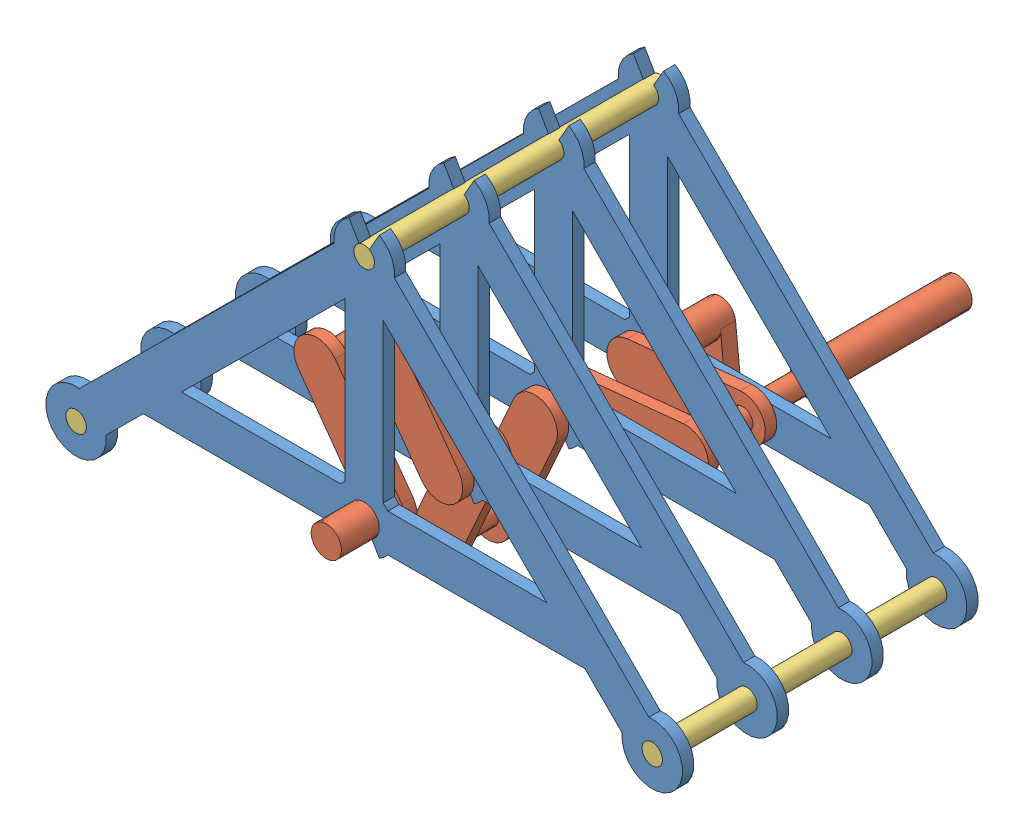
SolidWorks assembly 驱动结构.SLDASM, configuration 默认 (file format 15000). Lengths in mm.
Overall size (84 50.43 82).
8 component instances, 3 part files, 19 mates.
Components (placement in the parent):
- 两侧三角支架-1: 两侧三角支架.SLDPRT [默认] at (0.7562 -6.4117 -2.8963) size (84 45.26 1.5)
- 中心摇杆-2: 中心摇杆.SLDPRT [默认] at (0.7562 -6.4117 -2.8963) x (0.100452 -0.994942 0) z (0 0 1) size (31.98 28.5 82)
- 两侧三角支架-2: 两侧三角支架.SLDPRT [默认] at (0.7562 -6.4117 9.6037) size (84 45.26 1.5)
- 两侧三角支架-4: 两侧三角支架.SLDPRT [默认] at (0.7562 -6.4117 22.1037) size (84 45.26 1.5)
- 两侧三角支架-5: 两侧三角支架.SLDPRT [默认] at (0.7562 -6.4117 34.6037) size (84 45.26 1.5)
- 圆柱-1: 圆柱.SLDPRT [默认] at (0.7562 23.5883 -2.8963) size (2.7 2.7 39)
- 圆柱-2: 圆柱.SLDPRT [默认] at (38.7562 -14.2117 -2.8963) size (2.7 2.7 39)
- 圆柱-3: 圆柱.SLDPRT [默认] at (-37.2438 -14.2117 -2.8963) size (2.7 2.7 39)
Mates (geometry in assembly coordinates):
- 同心1: concentric aligned: cylinder of 两侧三角支架-1 through (0.7562 -6.4117 -1.3963) axis (0 0 -1) radius 1.35; cylinder of 中心摇杆-2 through (0.7562 -6.4117 -0.3963) axis (0 0 -1) radius 1.35
- 重合1: coincident anti-aligned: plane of 两侧三角支架-1 through (0.7562 -6.4117 -1.3963) normal (0 0 1); plane of 中心摇杆-2 through (0.7562 -6.4117 -1.3963) normal (0 0 -1)
- 同心2: concentric aligned: line of 中心摇杆-2 through (0.7562 -6.4117 11.1037) axis (0 0 -1); cylinder of 两侧三角支架-2 through (0.7562 -6.4117 11.1037) axis (0 0 -1) radius 1.35
- 重合2: coincident anti-aligned: plane of 中心摇杆-2 through (0.7562 -6.4117 9.6037) normal (0 0 1); plane of 两侧三角支架-2 through (0.7562 -6.4117 9.6037) normal (0 0 -1)
- 平行1: parallel aligned: line of 两侧三角支架-1 through (38.3056 -10.2372 -2.8963) axis (-0.70897 0.705239 0); line of 两侧三角支架-2 through (38.3056 -10.2372 9.6037) axis (-0.70897 0.705239 0)
- 同心3: concentric aligned: line of 中心摇杆-2 through (0.7562 -6.4117 23.6037) axis (0 0 -1); cylinder of 两侧三角支架-4 through (0.7562 -6.4117 23.6037) axis (0 0 -1) radius 1.35
- 同心4: concentric aligned: cylinder of 中心摇杆-2 through (0.7562 -6.4117 24.6037) axis (0 0 -1) radius 1.35; cylinder of 两侧三角支架-4 through (0.7562 -6.4117 23.6037) axis (0 0 -1) radius 1.35
- 重合4: coincident anti-aligned: plane of 中心摇杆-2 through (0.7562 -6.4117 22.1037) normal (0 0 1); plane of 两侧三角支架-4 through (0.7562 -6.4117 22.1037) normal (0 0 -1)
- 平行2: parallel aligned: line of 两侧三角支架-2 through (38.3056 -10.2372 9.6037) axis (-0.70897 0.705239 0); line of 两侧三角支架-4 through (38.3056 -10.2372 22.1037) axis (-0.70897 0.705239 0)
- 同心5: concentric aligned: cylinder of 中心摇杆-2 through (0.7562 -6.4117 36.1037) axis (0 0 -1) radius 1.35; cylinder of 两侧三角支架-5 through (0.7562 -6.4117 36.1037) axis (0 0 -1) radius 1.35
- 重合6: coincident anti-aligned: plane of 中心摇杆-2 through (0.7562 -6.4117 34.6037) normal (0 0 1); plane of 两侧三角支架-5 through (0.7562 -6.4117 34.6037) normal (0 0 -1)
- 同心6: concentric aligned: cylinder of 两侧三角支架-1 through (0.7562 23.5883 -1.3963) axis (0 0 -1) radius 1.35; cylinder of 圆柱-1 through (0.7562 23.5883 36.1037) axis (0 0 -1) radius 1.35
- 重合7: coincident aligned: plane of 两侧三角支架-1 through (0.7562 -6.4117 -2.8963) normal (0 0 -1); plane of 圆柱-1 through (0.7562 23.5883 -2.8963) normal (0 0 -1)
- 同心7: concentric aligned: line of 两侧三角支架-1 through (38.7562 -14.2117 -1.3963) axis (0 0 -1); cylinder of 圆柱-2 through (38.7562 -14.2117 36.1037) axis (0 0 -1) radius 1.35
- 同心8: concentric aligned: cylinder of 两侧三角支架-1 through (38.7562 -14.2117 -1.3963) axis (0 0 -1) radius 1.35; cylinder of 圆柱-2 through (38.7562 -14.2117 36.1037) axis (0 0 -1) radius 1.35
- 重合8: coincident aligned: plane of 两侧三角支架-1 through (0.7562 -6.4117 -2.8963) normal (0 0 -1); plane of 圆柱-2 through (38.7562 -14.2117 -2.8963) normal (0 0 -1)
- 同心9: concentric aligned: cylinder of 两侧三角支架-1 through (-37.2438 -14.2117 -1.3963) axis (0 0 -1) radius 1.35; cylinder of 圆柱-3 through (-37.2438 -14.2117 36.1037) axis (0 0 -1) radius 1.35
- 重合9: coincident aligned: plane of 两侧三角支架-5 through (0.7562 -6.4117 36.1037) normal (0 0 1); plane of 圆柱-3 through (-37.2438 -14.2117 36.1037) normal (0 0 1)
- 平行3: parallel aligned: line of 两侧三角支架-4 through (38.3056 -10.2372 22.1037) axis (-0.70897 0.705239 0); line of 两侧三角支架-5 through (38.3056 -10.2372 34.6037) axis (-0.70897 0.705239 0)
